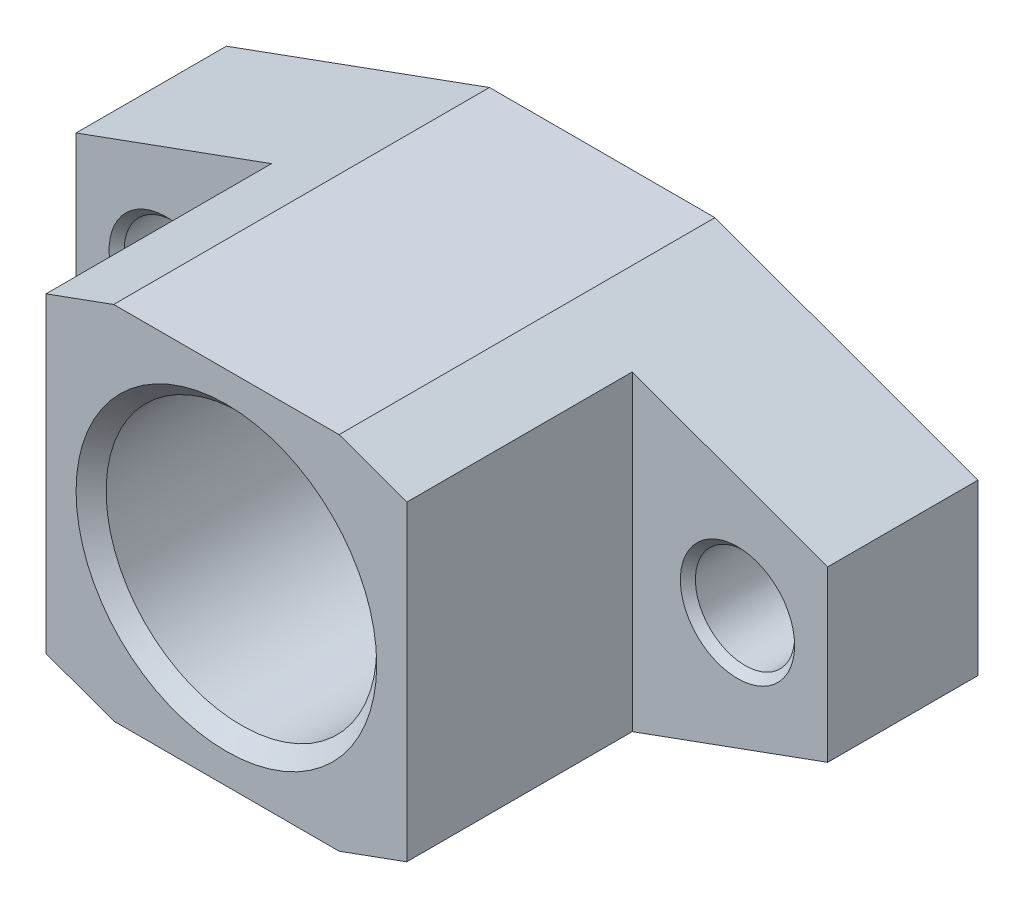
ISO-10303-21;
HEADER;
FILE_DESCRIPTION(('STEP AP214'),'2;1');
FILE_NAME('part.step','',(''),(''),'','','');
FILE_SCHEMA(('AUTOMOTIVE_DESIGN { 1 0 10303 214 1 1 1 1 }'));
ENDSEC;
DATA;
#1=APPLICATION_CONTEXT('core data for automotive mechanical design processes');
#2=APPLICATION_PROTOCOL_DEFINITION('international standard','automotive_design',2000,#1);
#3=PRODUCT_CONTEXT('',#1,'mechanical');
#4=PRODUCT('Part','Part','',(#3));
#5=PRODUCT_RELATED_PRODUCT_CATEGORY('part','',(#4));
#6=PRODUCT_DEFINITION_FORMATION('','',#4);
#7=PRODUCT_DEFINITION_CONTEXT('part definition',#1,'design');
#8=PRODUCT_DEFINITION('design','',#6,#7);
#9=PRODUCT_DEFINITION_SHAPE('','',#8);
#10=(LENGTH_UNIT() NAMED_UNIT(*) SI_UNIT(.MILLI.,.METRE.));
#11=(NAMED_UNIT(*) PLANE_ANGLE_UNIT() SI_UNIT($,.RADIAN.));
#12=(NAMED_UNIT(*) SI_UNIT($,.STERADIAN.) SOLID_ANGLE_UNIT());
#13=UNCERTAINTY_MEASURE_WITH_UNIT(LENGTH_MEASURE(1.E-05),#10,'distance_accuracy_value','');
#14=(GEOMETRIC_REPRESENTATION_CONTEXT(3) GLOBAL_UNCERTAINTY_ASSIGNED_CONTEXT((#13)) GLOBAL_UNIT_ASSIGNED_CONTEXT((#10,
#11,#12)) REPRESENTATION_CONTEXT('',''));
#15=CARTESIAN_POINT('',(0.,0.,0.));
#16=DIRECTION('',(0.,0.,1.));
#17=DIRECTION('',(1.,0.,0.));
#18=AXIS2_PLACEMENT_3D('',#15,#16,#17);
#19=CARTESIAN_POINT('',(-25.,5.63052090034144,10.));
#20=DIRECTION('',(0.,0.,1.));
#21=DIRECTION('',(1.,0.,0.));
#22=AXIS2_PLACEMENT_3D('',#19,#20,#21);
#23=PLANE('',#22);
#24=CARTESIAN_POINT('',(19.,0.,10.));
#25=DIRECTION('',(0.,0.,1.));
#26=DIRECTION('',(1.,0.,0.));
#27=AXIS2_PLACEMENT_3D('',#24,#25,#26);
#28=CIRCLE('',#27,3.8);
#29=CARTESIAN_POINT('',(22.8,0.,10.));
#30=VERTEX_POINT('',#29);
#31=EDGE_CURVE('E486',#30,#30,#28,.T.);
#32=ORIENTED_EDGE('',*,*,#31,.F.);
#33=EDGE_LOOP('',(#32));
#34=FACE_BOUND('',#33,.T.);
#35=DIRECTION('',(0.,1.,0.));
#36=VECTOR('',#35,1.);
#37=CARTESIAN_POINT('',(12.,10.3621339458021,10.));
#38=LINE('',#37,#36);
#39=CARTESIAN_POINT('',(12.,-10.3621339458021,10.));
#40=VERTEX_POINT('',#39);
#41=CARTESIAN_POINT('',(12.,10.3621339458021,10.));
#42=VERTEX_POINT('',#41);
#43=EDGE_CURVE('E35',#40,#42,#38,.T.);
#44=ORIENTED_EDGE('',*,*,#43,.F.);
#45=DIRECTION('',(0.939692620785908,0.342020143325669,0.));
#46=VECTOR('',#45,1.);
#47=CARTESIAN_POINT('',(7.5,-12.,10.));
#48=LINE('',#47,#46);
#49=CARTESIAN_POINT('',(25.,-5.63052090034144,10.));
#50=VERTEX_POINT('',#49);
#51=EDGE_CURVE('E161',#40,#50,#48,.T.);
#52=ORIENTED_EDGE('',*,*,#51,.T.);
#53=DIRECTION('',(0.,1.,0.));
#54=VECTOR('',#53,1.);
#55=CARTESIAN_POINT('',(25.,5.63052090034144,10.));
#56=LINE('',#55,#54);
#57=CARTESIAN_POINT('',(25.,5.63052090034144,10.));
#58=VERTEX_POINT('',#57);
#59=EDGE_CURVE('E167',#50,#58,#56,.T.);
#60=ORIENTED_EDGE('',*,*,#59,.T.);
#61=DIRECTION('',(-0.939692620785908,0.342020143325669,0.));
#62=VECTOR('',#61,1.);
#63=CARTESIAN_POINT('',(7.5,12.,10.));
#64=LINE('',#63,#62);
#65=EDGE_CURVE('E31',#58,#42,#64,.T.);
#66=ORIENTED_EDGE('',*,*,#65,.T.);
#67=EDGE_LOOP('',(#44,#52,#60,#66));
#68=FACE_BOUND('',#67,.T.);
#69=ADVANCED_FACE('F14',(#34,#68),#23,.T.);
#70=CARTESIAN_POINT('',(-7.5,12.,10.));
#71=DIRECTION('',(0.342020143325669,-0.939692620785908,0.));
#72=DIRECTION('',(0.939692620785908,0.342020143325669,0.));
#73=AXIS2_PLACEMENT_3D('',#70,#71,#72);
#74=PLANE('',#73);
#75=DIRECTION('',(-0.939692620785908,-0.342020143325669,0.));
#76=VECTOR('',#75,1.);
#77=CARTESIAN_POINT('',(-7.5,12.,0.));
#78=LINE('',#77,#76);
#79=CARTESIAN_POINT('',(-7.5,12.,0.));
#80=VERTEX_POINT('',#79);
#81=CARTESIAN_POINT('',(-25.,5.63052090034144,0.));
#82=VERTEX_POINT('',#81);
#83=EDGE_CURVE('E130',#80,#82,#78,.T.);
#84=ORIENTED_EDGE('',*,*,#83,.T.);
#85=DIRECTION('',(0.,0.,-1.));
#86=VECTOR('',#85,1.);
#87=CARTESIAN_POINT('',(-25.,5.63052090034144,10.));
#88=LINE('',#87,#86);
#89=CARTESIAN_POINT('',(-25.,5.63052090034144,10.));
#90=VERTEX_POINT('',#89);
#91=EDGE_CURVE('E9',#90,#82,#88,.T.);
#92=ORIENTED_EDGE('',*,*,#91,.F.);
#93=DIRECTION('',(-0.939692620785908,-0.342020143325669,0.));
#94=VECTOR('',#93,1.);
#95=CARTESIAN_POINT('',(-7.5,12.,10.));
#96=LINE('',#95,#94);
#97=CARTESIAN_POINT('',(-12.,10.3621339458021,10.));
#98=VERTEX_POINT('',#97);
#99=EDGE_CURVE('E129',#98,#90,#96,.T.);
#100=ORIENTED_EDGE('',*,*,#99,.F.);
#101=DIRECTION('',(0.,0.,-1.));
#102=VECTOR('',#101,1.);
#103=CARTESIAN_POINT('',(-12.,10.3621339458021,25.));
#104=LINE('',#103,#102);
#105=CARTESIAN_POINT('',(-12.,10.3621339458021,25.));
#106=VERTEX_POINT('',#105);
#107=EDGE_CURVE('E108',#106,#98,#104,.T.);
#108=ORIENTED_EDGE('',*,*,#107,.F.);
#109=DIRECTION('',(-0.939692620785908,-0.342020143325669,0.));
#110=VECTOR('',#109,1.);
#111=CARTESIAN_POINT('',(-7.5,12.,25.));
#112=LINE('',#111,#110);
#113=CARTESIAN_POINT('',(-7.5,12.,25.));
#114=VERTEX_POINT('',#113);
#115=EDGE_CURVE('E115',#114,#106,#112,.T.);
#116=ORIENTED_EDGE('',*,*,#115,.F.);
#117=DIRECTION('',(0.,0.,-1.));
#118=VECTOR('',#117,1.);
#119=CARTESIAN_POINT('',(-7.5,12.,10.));
#120=LINE('',#119,#118);
#121=EDGE_CURVE('E172',#114,#80,#120,.T.);
#122=ORIENTED_EDGE('',*,*,#121,.T.);
#123=EDGE_LOOP('',(#84,#92,#100,#108,#116,#122));
#124=FACE_BOUND('',#123,.T.);
#125=ADVANCED_FACE('F16',(#124),#74,.F.);
#126=CARTESIAN_POINT('',(-25.,5.63052090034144,10.));
#127=DIRECTION('',(1.,0.,0.));
#128=DIRECTION('',(0.,0.,-1.));
#129=AXIS2_PLACEMENT_3D('',#126,#127,#128);
#130=PLANE('',#129);
#131=DIRECTION('',(0.,-1.,0.));
#132=VECTOR('',#131,1.);
#133=CARTESIAN_POINT('',(-25.,5.63052090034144,0.));
#134=LINE('',#133,#132);
#135=CARTESIAN_POINT('',(-25.,-5.63052090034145,0.));
#136=VERTEX_POINT('',#135);
#137=EDGE_CURVE('E132',#82,#136,#134,.T.);
#138=ORIENTED_EDGE('',*,*,#137,.T.);
#139=DIRECTION('',(0.,0.,-1.));
#140=VECTOR('',#139,1.);
#141=CARTESIAN_POINT('',(-25.,-5.63052090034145,10.));
#142=LINE('',#141,#140);
#143=CARTESIAN_POINT('',(-25.,-5.63052090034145,10.));
#144=VERTEX_POINT('',#143);
#145=EDGE_CURVE('E23',#144,#136,#142,.T.);
#146=ORIENTED_EDGE('',*,*,#145,.F.);
#147=DIRECTION('',(0.,-1.,0.));
#148=VECTOR('',#147,1.);
#149=CARTESIAN_POINT('',(-25.,5.63052090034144,10.));
#150=LINE('',#149,#148);
#151=EDGE_CURVE('E153',#90,#144,#150,.T.);
#152=ORIENTED_EDGE('',*,*,#151,.F.);
#153=ORIENTED_EDGE('',*,*,#91,.T.);
#154=EDGE_LOOP('',(#138,#146,#152,#153));
#155=FACE_BOUND('',#154,.T.);
#156=ADVANCED_FACE('F244',(#155),#130,.F.);
#157=CARTESIAN_POINT('',(-7.5,-12.,10.));
#158=DIRECTION('',(0.342020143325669,0.939692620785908,0.));
#159=DIRECTION('',(-0.939692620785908,0.342020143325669,0.));
#160=AXIS2_PLACEMENT_3D('',#157,#158,#159);
#161=PLANE('',#160);
#162=DIRECTION('',(0.939692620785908,-0.342020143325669,0.));
#163=VECTOR('',#162,1.);
#164=CARTESIAN_POINT('',(-7.5,-12.,0.));
#165=LINE('',#164,#163);
#166=CARTESIAN_POINT('',(-7.5,-12.,0.));
#167=VERTEX_POINT('',#166);
#168=EDGE_CURVE('E288',#136,#167,#165,.T.);
#169=ORIENTED_EDGE('',*,*,#168,.T.);
#170=DIRECTION('',(0.,0.,-1.));
#171=VECTOR('',#170,1.);
#172=CARTESIAN_POINT('',(-7.5,-12.,10.));
#173=LINE('',#172,#171);
#174=CARTESIAN_POINT('',(-7.5,-12.,25.));
#175=VERTEX_POINT('',#174);
#176=EDGE_CURVE('E268',#175,#167,#173,.T.);
#177=ORIENTED_EDGE('',*,*,#176,.F.);
#178=DIRECTION('',(0.939692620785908,-0.342020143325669,0.));
#179=VECTOR('',#178,1.);
#180=CARTESIAN_POINT('',(-12.,-10.3621339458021,25.));
#181=LINE('',#180,#179);
#182=CARTESIAN_POINT('',(-12.,-10.3621339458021,25.));
#183=VERTEX_POINT('',#182);
#184=EDGE_CURVE('E114',#183,#175,#181,.T.);
#185=ORIENTED_EDGE('',*,*,#184,.F.);
#186=DIRECTION('',(0.,0.,-1.));
#187=VECTOR('',#186,1.);
#188=CARTESIAN_POINT('',(-12.,-10.3621339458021,25.));
#189=LINE('',#188,#187);
#190=CARTESIAN_POINT('',(-12.,-10.3621339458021,10.));
#191=VERTEX_POINT('',#190);
#192=EDGE_CURVE('E110',#183,#191,#189,.T.);
#193=ORIENTED_EDGE('',*,*,#192,.T.);
#194=DIRECTION('',(0.939692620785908,-0.342020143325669,0.));
#195=VECTOR('',#194,1.);
#196=CARTESIAN_POINT('',(-7.5,-12.,10.));
#197=LINE('',#196,#195);
#198=EDGE_CURVE('E159',#144,#191,#197,.T.);
#199=ORIENTED_EDGE('',*,*,#198,.F.);
#200=ORIENTED_EDGE('',*,*,#145,.T.);
#201=EDGE_LOOP('',(#169,#177,#185,#193,#199,#200));
#202=FACE_BOUND('',#201,.T.);
#203=ADVANCED_FACE('F265',(#202),#161,.F.);
#204=CARTESIAN_POINT('',(7.5,-12.,10.));
#205=DIRECTION('',(0.,1.,0.));
#206=DIRECTION('',(0.,0.,1.));
#207=AXIS2_PLACEMENT_3D('',#204,#205,#206);
#208=PLANE('',#207);
#209=DIRECTION('',(1.,0.,0.));
#210=VECTOR('',#209,1.);
#211=CARTESIAN_POINT('',(7.5,-12.,0.));
#212=LINE('',#211,#210);
#213=CARTESIAN_POINT('',(7.5,-12.,0.));
#214=VERTEX_POINT('',#213);
#215=EDGE_CURVE('E274',#167,#214,#212,.T.);
#216=ORIENTED_EDGE('',*,*,#215,.T.);
#217=DIRECTION('',(0.,0.,-1.));
#218=VECTOR('',#217,1.);
#219=CARTESIAN_POINT('',(7.5,-12.,10.));
#220=LINE('',#219,#218);
#221=CARTESIAN_POINT('',(7.5,-12.,25.));
#222=VERTEX_POINT('',#221);
#223=EDGE_CURVE('E273',#222,#214,#220,.T.);
#224=ORIENTED_EDGE('',*,*,#223,.F.);
#225=DIRECTION('',(1.,0.,0.));
#226=VECTOR('',#225,1.);
#227=CARTESIAN_POINT('',(-7.5,-12.,25.));
#228=LINE('',#227,#226);
#229=EDGE_CURVE('E185',#175,#222,#228,.T.);
#230=ORIENTED_EDGE('',*,*,#229,.F.);
#231=ORIENTED_EDGE('',*,*,#176,.T.);
#232=EDGE_LOOP('',(#216,#224,#230,#231));
#233=FACE_BOUND('',#232,.T.);
#234=ADVANCED_FACE('F271',(#233),#208,.F.);
#235=CARTESIAN_POINT('',(7.5,-12.,10.));
#236=DIRECTION('',(-0.342020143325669,0.939692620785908,0.));
#237=DIRECTION('',(-0.939692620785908,-0.342020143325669,0.));
#238=AXIS2_PLACEMENT_3D('',#235,#236,#237);
#239=PLANE('',#238);
#240=DIRECTION('',(0.939692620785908,0.342020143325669,0.));
#241=VECTOR('',#240,1.);
#242=CARTESIAN_POINT('',(7.5,-12.,0.));
#243=LINE('',#242,#241);
#244=CARTESIAN_POINT('',(25.,-5.63052090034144,0.));
#245=VERTEX_POINT('',#244);
#246=EDGE_CURVE('E285',#214,#245,#243,.T.);
#247=ORIENTED_EDGE('',*,*,#246,.T.);
#248=DIRECTION('',(0.,0.,-1.));
#249=VECTOR('',#248,1.);
#250=CARTESIAN_POINT('',(25.,-5.63052090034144,10.));
#251=LINE('',#250,#249);
#252=EDGE_CURVE('E209',#50,#245,#251,.T.);
#253=ORIENTED_EDGE('',*,*,#252,.F.);
#254=ORIENTED_EDGE('',*,*,#51,.F.);
#255=DIRECTION('',(0.,0.,-1.));
#256=VECTOR('',#255,1.);
#257=CARTESIAN_POINT('',(12.,-10.3621339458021,25.));
#258=LINE('',#257,#256);
#259=CARTESIAN_POINT('',(12.,-10.3621339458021,25.));
#260=VERTEX_POINT('',#259);
#261=EDGE_CURVE('E134',#260,#40,#258,.T.);
#262=ORIENTED_EDGE('',*,*,#261,.F.);
#263=DIRECTION('',(0.939692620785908,0.342020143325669,0.));
#264=VECTOR('',#263,1.);
#265=CARTESIAN_POINT('',(7.5,-12.,25.));
#266=LINE('',#265,#264);
#267=EDGE_CURVE('E188',#222,#260,#266,.T.);
#268=ORIENTED_EDGE('',*,*,#267,.F.);
#269=ORIENTED_EDGE('',*,*,#223,.T.);
#270=EDGE_LOOP('',(#247,#253,#254,#262,#268,#269));
#271=FACE_BOUND('',#270,.T.);
#272=ADVANCED_FACE('F205',(#271),#239,.F.);
#273=CARTESIAN_POINT('',(25.,5.63052090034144,10.));
#274=DIRECTION('',(-1.,0.,0.));
#275=DIRECTION('',(0.,0.,1.));
#276=AXIS2_PLACEMENT_3D('',#273,#274,#275);
#277=PLANE('',#276);
#278=DIRECTION('',(0.,1.,0.));
#279=VECTOR('',#278,1.);
#280=CARTESIAN_POINT('',(25.,5.63052090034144,0.));
#281=LINE('',#280,#279);
#282=CARTESIAN_POINT('',(25.,5.63052090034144,0.));
#283=VERTEX_POINT('',#282);
#284=EDGE_CURVE('E217',#245,#283,#281,.T.);
#285=ORIENTED_EDGE('',*,*,#284,.T.);
#286=DIRECTION('',(0.,0.,-1.));
#287=VECTOR('',#286,1.);
#288=CARTESIAN_POINT('',(25.,5.63052090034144,10.));
#289=LINE('',#288,#287);
#290=EDGE_CURVE('E214',#58,#283,#289,.T.);
#291=ORIENTED_EDGE('',*,*,#290,.F.);
#292=ORIENTED_EDGE('',*,*,#59,.F.);
#293=ORIENTED_EDGE('',*,*,#252,.T.);
#294=EDGE_LOOP('',(#285,#291,#292,#293));
#295=FACE_BOUND('',#294,.T.);
#296=ADVANCED_FACE('F215',(#295),#277,.F.);
#297=CARTESIAN_POINT('',(7.5,12.,10.));
#298=DIRECTION('',(-0.342020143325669,-0.939692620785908,0.));
#299=DIRECTION('',(0.939692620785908,-0.342020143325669,0.));
#300=AXIS2_PLACEMENT_3D('',#297,#298,#299);
#301=PLANE('',#300);
#302=DIRECTION('',(-0.939692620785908,0.342020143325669,0.));
#303=VECTOR('',#302,1.);
#304=CARTESIAN_POINT('',(7.5,12.,0.));
#305=LINE('',#304,#303);
#306=CARTESIAN_POINT('',(7.5,12.,0.));
#307=VERTEX_POINT('',#306);
#308=EDGE_CURVE('E222',#283,#307,#305,.T.);
#309=ORIENTED_EDGE('',*,*,#308,.T.);
#310=DIRECTION('',(0.,0.,-1.));
#311=VECTOR('',#310,1.);
#312=CARTESIAN_POINT('',(7.5,12.,10.));
#313=LINE('',#312,#311);
#314=CARTESIAN_POINT('',(7.5,12.,25.));
#315=VERTEX_POINT('',#314);
#316=EDGE_CURVE('E219',#315,#307,#313,.T.);
#317=ORIENTED_EDGE('',*,*,#316,.F.);
#318=DIRECTION('',(-0.939692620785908,0.342020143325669,0.));
#319=VECTOR('',#318,1.);
#320=CARTESIAN_POINT('',(12.,10.3621339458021,25.));
#321=LINE('',#320,#319);
#322=CARTESIAN_POINT('',(12.,10.3621339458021,25.));
#323=VERTEX_POINT('',#322);
#324=EDGE_CURVE('E192',#323,#315,#321,.T.);
#325=ORIENTED_EDGE('',*,*,#324,.F.);
#326=DIRECTION('',(0.,0.,-1.));
#327=VECTOR('',#326,1.);
#328=CARTESIAN_POINT('',(12.,10.3621339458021,25.));
#329=LINE('',#328,#327);
#330=EDGE_CURVE('E144',#323,#42,#329,.T.);
#331=ORIENTED_EDGE('',*,*,#330,.T.);
#332=ORIENTED_EDGE('',*,*,#65,.F.);
#333=ORIENTED_EDGE('',*,*,#290,.T.);
#334=EDGE_LOOP('',(#309,#317,#325,#331,#332,#333));
#335=FACE_BOUND('',#334,.T.);
#336=ADVANCED_FACE('F221',(#335),#301,.F.);
#337=CARTESIAN_POINT('',(7.5,12.,10.));
#338=DIRECTION('',(0.,-1.,0.));
#339=DIRECTION('',(0.,0.,-1.));
#340=AXIS2_PLACEMENT_3D('',#337,#338,#339);
#341=PLANE('',#340);
#342=DIRECTION('',(-1.,0.,0.));
#343=VECTOR('',#342,1.);
#344=CARTESIAN_POINT('',(7.5,12.,0.));
#345=LINE('',#344,#343);
#346=EDGE_CURVE('E157',#307,#80,#345,.T.);
#347=ORIENTED_EDGE('',*,*,#346,.T.);
#348=ORIENTED_EDGE('',*,*,#121,.F.);
#349=DIRECTION('',(-1.,0.,0.));
#350=VECTOR('',#349,1.);
#351=CARTESIAN_POINT('',(7.5,12.,25.));
#352=LINE('',#351,#350);
#353=EDGE_CURVE('E122',#315,#114,#352,.T.);
#354=ORIENTED_EDGE('',*,*,#353,.F.);
#355=ORIENTED_EDGE('',*,*,#316,.T.);
#356=EDGE_LOOP('',(#347,#348,#354,#355));
#357=FACE_BOUND('',#356,.T.);
#358=ADVANCED_FACE('F225',(#357),#341,.F.);
#359=CARTESIAN_POINT('',(-19.,0.,10.));
#360=DIRECTION('',(0.,0.,1.));
#361=DIRECTION('',(1.,0.,0.));
#362=AXIS2_PLACEMENT_3D('',#359,#360,#361);
#363=CIRCLE('',#362,3.8);
#364=CARTESIAN_POINT('',(-15.2,0.,10.));
#365=VERTEX_POINT('',#364);
#366=EDGE_CURVE('E259',#365,#365,#363,.T.);
#367=ORIENTED_EDGE('',*,*,#366,.F.);
#368=EDGE_LOOP('',(#367));
#369=FACE_BOUND('',#368,.T.);
#370=DIRECTION('',(0.,-1.,0.));
#371=VECTOR('',#370,1.);
#372=CARTESIAN_POINT('',(-12.,10.3621339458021,10.));
#373=LINE('',#372,#371);
#374=EDGE_CURVE('E143',#98,#191,#373,.T.);
#375=ORIENTED_EDGE('',*,*,#374,.F.);
#376=ORIENTED_EDGE('',*,*,#99,.T.);
#377=ORIENTED_EDGE('',*,*,#151,.T.);
#378=ORIENTED_EDGE('',*,*,#198,.T.);
#379=EDGE_LOOP('',(#375,#376,#377,#378));
#380=FACE_BOUND('',#379,.T.);
#381=ADVANCED_FACE('F233',(#369,#380),#23,.T.);
#382=CARTESIAN_POINT('',(-25.,5.63052090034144,0.));
#383=DIRECTION('',(0.,0.,1.));
#384=DIRECTION('',(1.,0.,0.));
#385=AXIS2_PLACEMENT_3D('',#382,#383,#384);
#386=PLANE('',#385);
#387=CARTESIAN_POINT('',(-19.,0.,0.));
#388=DIRECTION('',(0.,0.,1.));
#389=DIRECTION('',(1.,0.,0.));
#390=AXIS2_PLACEMENT_3D('',#387,#388,#389);
#391=CIRCLE('',#390,3.8);
#392=CARTESIAN_POINT('',(-15.2,0.,0.));
#393=VERTEX_POINT('',#392);
#394=EDGE_CURVE('E483',#393,#393,#391,.T.);
#395=ORIENTED_EDGE('',*,*,#394,.T.);
#396=EDGE_LOOP('',(#395));
#397=FACE_BOUND('',#396,.T.);
#398=CARTESIAN_POINT('',(19.,0.,0.));
#399=DIRECTION('',(0.,0.,1.));
#400=DIRECTION('',(1.,0.,0.));
#401=AXIS2_PLACEMENT_3D('',#398,#399,#400);
#402=CIRCLE('',#401,3.8);
#403=CARTESIAN_POINT('',(22.8,0.,0.));
#404=VERTEX_POINT('',#403);
#405=EDGE_CURVE('E495',#404,#404,#402,.T.);
#406=ORIENTED_EDGE('',*,*,#405,.T.);
#407=EDGE_LOOP('',(#406));
#408=FACE_BOUND('',#407,.T.);
#409=CARTESIAN_POINT('',(0.,0.,0.));
#410=DIRECTION('',(0.,0.,1.));
#411=DIRECTION('',(1.,0.,0.));
#412=AXIS2_PLACEMENT_3D('',#409,#410,#411);
#413=CIRCLE('',#412,10.);
#414=CARTESIAN_POINT('',(10.,0.,0.));
#415=VERTEX_POINT('',#414);
#416=EDGE_CURVE('E173',#415,#415,#413,.T.);
#417=ORIENTED_EDGE('',*,*,#416,.T.);
#418=EDGE_LOOP('',(#417));
#419=FACE_BOUND('',#418,.T.);
#420=ORIENTED_EDGE('',*,*,#83,.F.);
#421=ORIENTED_EDGE('',*,*,#346,.F.);
#422=ORIENTED_EDGE('',*,*,#308,.F.);
#423=ORIENTED_EDGE('',*,*,#284,.F.);
#424=ORIENTED_EDGE('',*,*,#246,.F.);
#425=ORIENTED_EDGE('',*,*,#215,.F.);
#426=ORIENTED_EDGE('',*,*,#168,.F.);
#427=ORIENTED_EDGE('',*,*,#137,.F.);
#428=EDGE_LOOP('',(#420,#421,#422,#423,#424,#425,#426,#427));
#429=FACE_BOUND('',#428,.T.);
#430=ADVANCED_FACE('F249',(#397,#408,#419,#429),#386,.F.);
#431=CARTESIAN_POINT('',(-12.,10.3621339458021,25.));
#432=DIRECTION('',(1.,0.,0.));
#433=DIRECTION('',(0.,1.,0.));
#434=AXIS2_PLACEMENT_3D('',#431,#432,#433);
#435=PLANE('',#434);
#436=ORIENTED_EDGE('',*,*,#374,.T.);
#437=ORIENTED_EDGE('',*,*,#192,.F.);
#438=DIRECTION('',(0.,-1.,0.));
#439=VECTOR('',#438,1.);
#440=CARTESIAN_POINT('',(-12.,10.3621339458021,25.));
#441=LINE('',#440,#439);
#442=EDGE_CURVE('E103',#106,#183,#441,.T.);
#443=ORIENTED_EDGE('',*,*,#442,.F.);
#444=ORIENTED_EDGE('',*,*,#107,.T.);
#445=EDGE_LOOP('',(#436,#437,#443,#444));
#446=FACE_BOUND('',#445,.T.);
#447=ADVANCED_FACE('F106',(#446),#435,.F.);
#448=CARTESIAN_POINT('',(12.,10.3621339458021,25.));
#449=DIRECTION('',(-1.,0.,0.));
#450=DIRECTION('',(0.,-1.,0.));
#451=AXIS2_PLACEMENT_3D('',#448,#449,#450);
#452=PLANE('',#451);
#453=ORIENTED_EDGE('',*,*,#43,.T.);
#454=ORIENTED_EDGE('',*,*,#330,.F.);
#455=DIRECTION('',(0.,1.,0.));
#456=VECTOR('',#455,1.);
#457=CARTESIAN_POINT('',(12.,10.3621339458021,25.));
#458=LINE('',#457,#456);
#459=EDGE_CURVE('E190',#260,#323,#458,.T.);
#460=ORIENTED_EDGE('',*,*,#459,.F.);
#461=ORIENTED_EDGE('',*,*,#261,.T.);
#462=EDGE_LOOP('',(#453,#454,#460,#461));
#463=FACE_BOUND('',#462,.T.);
#464=ADVANCED_FACE('F202',(#463),#452,.F.);
#465=CARTESIAN_POINT('',(-12.,10.3621339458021,25.));
#466=DIRECTION('',(0.,0.,1.));
#467=DIRECTION('',(1.,0.,0.));
#468=AXIS2_PLACEMENT_3D('',#465,#466,#467);
#469=PLANE('',#468);
#470=CARTESIAN_POINT('',(0.,0.,25.));
#471=DIRECTION('',(0.,0.,1.));
#472=DIRECTION('',(1.,0.,0.));
#473=AXIS2_PLACEMENT_3D('',#470,#471,#472);
#474=CIRCLE('',#473,10.);
#475=CARTESIAN_POINT('',(10.,0.,25.));
#476=VERTEX_POINT('',#475);
#477=EDGE_CURVE('E498',#476,#476,#474,.T.);
#478=ORIENTED_EDGE('',*,*,#477,.F.);
#479=EDGE_LOOP('',(#478));
#480=FACE_BOUND('',#479,.T.);
#481=ORIENTED_EDGE('',*,*,#115,.T.);
#482=ORIENTED_EDGE('',*,*,#442,.T.);
#483=ORIENTED_EDGE('',*,*,#184,.T.);
#484=ORIENTED_EDGE('',*,*,#229,.T.);
#485=ORIENTED_EDGE('',*,*,#267,.T.);
#486=ORIENTED_EDGE('',*,*,#459,.T.);
#487=ORIENTED_EDGE('',*,*,#324,.T.);
#488=ORIENTED_EDGE('',*,*,#353,.T.);
#489=EDGE_LOOP('',(#481,#482,#483,#484,#485,#486,#487,#488));
#490=FACE_BOUND('',#489,.T.);
#491=ADVANCED_FACE('F119',(#480,#490),#469,.T.);
#492=CARTESIAN_POINT('',(0.,0.,1.));
#493=DIRECTION('',(0.,0.,-1.));
#494=DIRECTION('',(-1.,0.,0.));
#495=AXIS2_PLACEMENT_3D('',#492,#493,#494);
#496=CONICAL_SURFACE('',#495,9.,0.785398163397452);
#497=ORIENTED_EDGE('',*,*,#416,.F.);
#498=EDGE_LOOP('',(#497));
#499=FACE_BOUND('',#498,.T.);
#500=CARTESIAN_POINT('',(0.,0.,1.));
#501=DIRECTION('',(0.,0.,1.));
#502=DIRECTION('',(1.,0.,0.));
#503=AXIS2_PLACEMENT_3D('',#500,#501,#502);
#504=CIRCLE('',#503,9.);
#505=CARTESIAN_POINT('',(9.,0.,1.));
#506=VERTEX_POINT('',#505);
#507=EDGE_CURVE('E175',#506,#506,#504,.T.);
#508=ORIENTED_EDGE('',*,*,#507,.T.);
#509=EDGE_LOOP('',(#508));
#510=FACE_BOUND('',#509,.T.);
#511=ADVANCED_FACE('F377',(#499,#510),#496,.F.);
#512=CARTESIAN_POINT('',(0.,0.,25.));
#513=DIRECTION('',(0.,0.,1.));
#514=DIRECTION('',(1.,0.,0.));
#515=AXIS2_PLACEMENT_3D('',#512,#513,#514);
#516=CYLINDRICAL_SURFACE('',#515,9.);
#517=ORIENTED_EDGE('',*,*,#507,.F.);
#518=EDGE_LOOP('',(#517));
#519=FACE_BOUND('',#518,.T.);
#520=CARTESIAN_POINT('',(0.,0.,24.));
#521=DIRECTION('',(0.,0.,1.));
#522=DIRECTION('',(1.,0.,0.));
#523=AXIS2_PLACEMENT_3D('',#520,#521,#522);
#524=CIRCLE('',#523,9.);
#525=CARTESIAN_POINT('',(9.,0.,24.));
#526=VERTEX_POINT('',#525);
#527=EDGE_CURVE('E180',#526,#526,#524,.T.);
#528=ORIENTED_EDGE('',*,*,#527,.T.);
#529=EDGE_LOOP('',(#528));
#530=FACE_BOUND('',#529,.T.);
#531=ADVANCED_FACE('F386',(#519,#530),#516,.F.);
#532=CARTESIAN_POINT('',(0.,0.,25.));
#533=DIRECTION('',(0.,0.,1.));
#534=DIRECTION('',(1.,0.,0.));
#535=AXIS2_PLACEMENT_3D('',#532,#533,#534);
#536=CONICAL_SURFACE('',#535,10.,0.785398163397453);
#537=ORIENTED_EDGE('',*,*,#527,.F.);
#538=EDGE_LOOP('',(#537));
#539=FACE_BOUND('',#538,.T.);
#540=ORIENTED_EDGE('',*,*,#477,.T.);
#541=EDGE_LOOP('',(#540));
#542=FACE_BOUND('',#541,.T.);
#543=ADVANCED_FACE('F395',(#539,#542),#536,.F.);
#544=CARTESIAN_POINT('',(19.,0.,0.50000000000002));
#545=DIRECTION('',(0.,0.,-1.));
#546=DIRECTION('',(-1.,0.,0.));
#547=AXIS2_PLACEMENT_3D('',#544,#545,#546);
#548=CONICAL_SURFACE('',#547,3.3,0.785398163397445);
#549=ORIENTED_EDGE('',*,*,#405,.F.);
#550=EDGE_LOOP('',(#549));
#551=FACE_BOUND('',#550,.T.);
#552=CARTESIAN_POINT('',(19.,0.,0.50000000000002));
#553=DIRECTION('',(0.,0.,1.));
#554=DIRECTION('',(1.,0.,0.));
#555=AXIS2_PLACEMENT_3D('',#552,#553,#554);
#556=CIRCLE('',#555,3.3);
#557=CARTESIAN_POINT('',(22.3,0.,0.50000000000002));
#558=VERTEX_POINT('',#557);
#559=EDGE_CURVE('E492',#558,#558,#556,.T.);
#560=ORIENTED_EDGE('',*,*,#559,.T.);
#561=EDGE_LOOP('',(#560));
#562=FACE_BOUND('',#561,.T.);
#563=ADVANCED_FACE('F404',(#551,#562),#548,.F.);
#564=CARTESIAN_POINT('',(19.,0.,10.));
#565=DIRECTION('',(0.,0.,1.));
#566=DIRECTION('',(1.,0.,0.));
#567=AXIS2_PLACEMENT_3D('',#564,#565,#566);
#568=CYLINDRICAL_SURFACE('',#567,3.3);
#569=ORIENTED_EDGE('',*,*,#559,.F.);
#570=EDGE_LOOP('',(#569));
#571=FACE_BOUND('',#570,.T.);
#572=CARTESIAN_POINT('',(19.,0.,9.5));
#573=DIRECTION('',(0.,0.,1.));
#574=DIRECTION('',(1.,0.,0.));
#575=AXIS2_PLACEMENT_3D('',#572,#573,#574);
#576=CIRCLE('',#575,3.3);
#577=CARTESIAN_POINT('',(22.3,0.,9.5));
#578=VERTEX_POINT('',#577);
#579=EDGE_CURVE('E489',#578,#578,#576,.T.);
#580=ORIENTED_EDGE('',*,*,#579,.T.);
#581=EDGE_LOOP('',(#580));
#582=FACE_BOUND('',#581,.T.);
#583=ADVANCED_FACE('F413',(#571,#582),#568,.F.);
#584=CARTESIAN_POINT('',(19.,0.,10.));
#585=DIRECTION('',(0.,0.,1.));
#586=DIRECTION('',(1.,0.,0.));
#587=AXIS2_PLACEMENT_3D('',#584,#585,#586);
#588=CONICAL_SURFACE('',#587,3.8,0.78539816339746);
#589=ORIENTED_EDGE('',*,*,#579,.F.);
#590=EDGE_LOOP('',(#589));
#591=FACE_BOUND('',#590,.T.);
#592=ORIENTED_EDGE('',*,*,#31,.T.);
#593=EDGE_LOOP('',(#592));
#594=FACE_BOUND('',#593,.T.);
#595=ADVANCED_FACE('F422',(#591,#594),#588,.F.);
#596=CARTESIAN_POINT('',(-19.,0.,0.50000000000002));
#597=DIRECTION('',(0.,0.,-1.));
#598=DIRECTION('',(-1.,0.,0.));
#599=AXIS2_PLACEMENT_3D('',#596,#597,#598);
#600=CONICAL_SURFACE('',#599,3.3,0.785398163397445);
#601=ORIENTED_EDGE('',*,*,#394,.F.);
#602=EDGE_LOOP('',(#601));
#603=FACE_BOUND('',#602,.T.);
#604=CARTESIAN_POINT('',(-19.,0.,0.50000000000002));
#605=DIRECTION('',(0.,0.,1.));
#606=DIRECTION('',(1.,0.,0.));
#607=AXIS2_PLACEMENT_3D('',#604,#605,#606);
#608=CIRCLE('',#607,3.3);
#609=CARTESIAN_POINT('',(-15.7,0.,0.50000000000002));
#610=VERTEX_POINT('',#609);
#611=EDGE_CURVE('E478',#610,#610,#608,.T.);
#612=ORIENTED_EDGE('',*,*,#611,.T.);
#613=EDGE_LOOP('',(#612));
#614=FACE_BOUND('',#613,.T.);
#615=ADVANCED_FACE('F431',(#603,#614),#600,.F.);
#616=CARTESIAN_POINT('',(-19.,0.,10.));
#617=DIRECTION('',(0.,0.,1.));
#618=DIRECTION('',(1.,0.,0.));
#619=AXIS2_PLACEMENT_3D('',#616,#617,#618);
#620=CYLINDRICAL_SURFACE('',#619,3.3);
#621=ORIENTED_EDGE('',*,*,#611,.F.);
#622=EDGE_LOOP('',(#621));
#623=FACE_BOUND('',#622,.T.);
#624=CARTESIAN_POINT('',(-19.,0.,9.5));
#625=DIRECTION('',(0.,0.,1.));
#626=DIRECTION('',(1.,0.,0.));
#627=AXIS2_PLACEMENT_3D('',#624,#625,#626);
#628=CIRCLE('',#627,3.3);
#629=CARTESIAN_POINT('',(-15.7,0.,9.5));
#630=VERTEX_POINT('',#629);
#631=EDGE_CURVE('E476',#630,#630,#628,.T.);
#632=ORIENTED_EDGE('',*,*,#631,.T.);
#633=EDGE_LOOP('',(#632));
#634=FACE_BOUND('',#633,.T.);
#635=ADVANCED_FACE('F440',(#623,#634),#620,.F.);
#636=CARTESIAN_POINT('',(-19.,0.,10.));
#637=DIRECTION('',(0.,0.,1.));
#638=DIRECTION('',(1.,0.,0.));
#639=AXIS2_PLACEMENT_3D('',#636,#637,#638);
#640=CONICAL_SURFACE('',#639,3.8,0.785398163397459);
#641=ORIENTED_EDGE('',*,*,#631,.F.);
#642=EDGE_LOOP('',(#641));
#643=FACE_BOUND('',#642,.T.);
#644=ORIENTED_EDGE('',*,*,#366,.T.);
#645=EDGE_LOOP('',(#644));
#646=FACE_BOUND('',#645,.T.);
#647=ADVANCED_FACE('F449',(#643,#646),#640,.F.);
#648=CLOSED_SHELL('',(#69,#125,#156,#203,#234,#272,#296,#336,#358,#381,#430,#447,#464,#491,#511,
#531,#543,#563,#583,#595,#615,#635,#647));
#649=MANIFOLD_SOLID_BREP('B1',#648);
#650=ADVANCED_BREP_SHAPE_REPRESENTATION('',(#18,#649),#14);
#651=SHAPE_DEFINITION_REPRESENTATION(#9,#650);
ENDSEC;
END-ISO-10303-21;
